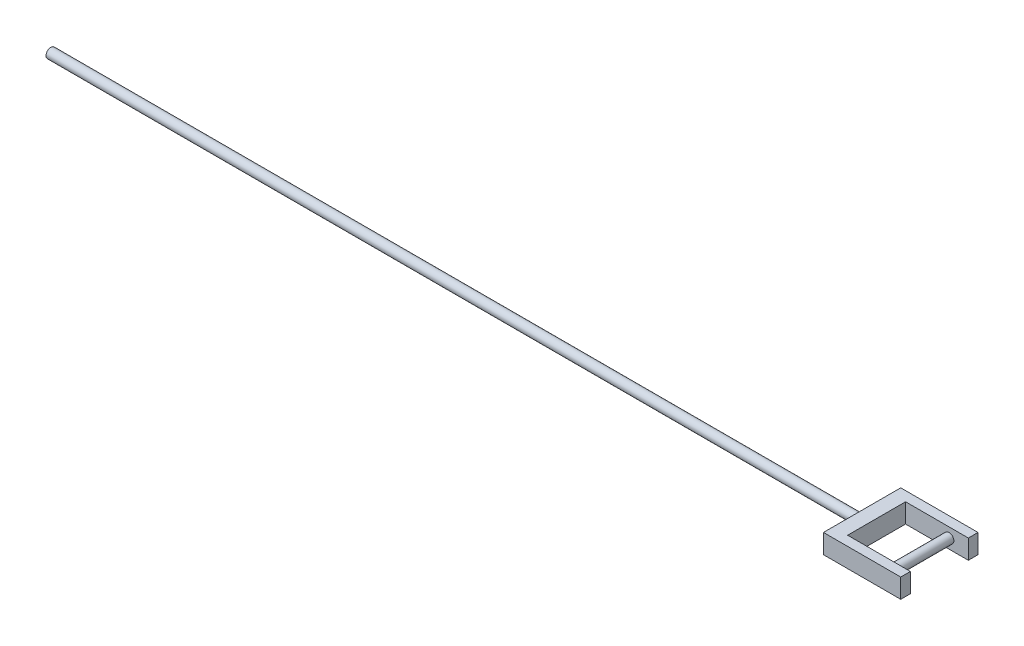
from build123d import *

# Parameters (mm, degrees)
BOSS_EXTRUDE1_DEPTH = 25.4
SKETCH2_R           = 12.7
BOSS_EXTRUDE2_DEPTH = 177.8
SKETCH3_R           = 12.7
BOSS_EXTRUDE3_DEPTH = 2133.6


with BuildPart() as part:
    # Sketch1 → Boss-Extrude1 (new, symmetric)
    with BuildSketch(Plane(origin=(0, 0, 0), x_dir=(1, 0, 0), z_dir=(0, 1, 0))):
        Polygon((50.8, 101.6), (-152.4, 101.6), (-152.4, -101.6), (50.8, -101.6), (50.8, -76.2), (-114.3, -76.2), (-114.3, 76.2), (50.8, 76.2), align=None)
    extrude(amount=BOSS_EXTRUDE1_DEPTH, both=True)

    # Sketch2 → Boss-Extrude2 (add)
    with BuildSketch(Plane.XY.offset(101.6)):
        Circle(SKETCH2_R)
    extrude(amount=-BOSS_EXTRUDE2_DEPTH)

    # Sketch3 → Boss-Extrude3 (add)
    with BuildSketch(Plane.ZY.offset(152.4)):
        with Locations(Location((0, 0, 0), (0, 0, 180))):
            Circle(SKETCH3_R)
    extrude(amount=BOSS_EXTRUDE3_DEPTH)


solid = part.part
